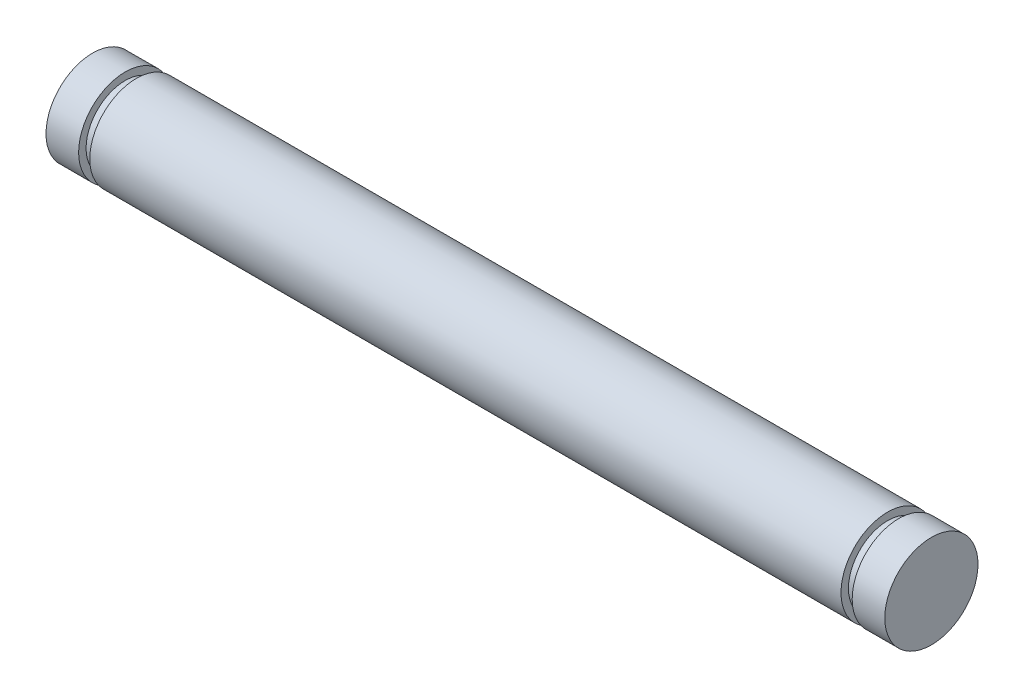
ISO-10303-21;
HEADER;
FILE_DESCRIPTION(('STEP AP214'),'2;1');
FILE_NAME('part.step','',(''),(''),'','','');
FILE_SCHEMA(('AUTOMOTIVE_DESIGN { 1 0 10303 214 1 1 1 1 }'));
ENDSEC;
DATA;
#1=APPLICATION_CONTEXT('core data for automotive mechanical design processes');
#2=APPLICATION_PROTOCOL_DEFINITION('international standard','automotive_design',2000,#1);
#3=PRODUCT_CONTEXT('',#1,'mechanical');
#4=PRODUCT('Part','Part','',(#3));
#5=PRODUCT_RELATED_PRODUCT_CATEGORY('part','',(#4));
#6=PRODUCT_DEFINITION_FORMATION('','',#4);
#7=PRODUCT_DEFINITION_CONTEXT('part definition',#1,'design');
#8=PRODUCT_DEFINITION('design','',#6,#7);
#9=PRODUCT_DEFINITION_SHAPE('','',#8);
#10=(LENGTH_UNIT() NAMED_UNIT(*) SI_UNIT(.MILLI.,.METRE.));
#11=(NAMED_UNIT(*) PLANE_ANGLE_UNIT() SI_UNIT($,.RADIAN.));
#12=(NAMED_UNIT(*) SI_UNIT($,.STERADIAN.) SOLID_ANGLE_UNIT());
#13=UNCERTAINTY_MEASURE_WITH_UNIT(LENGTH_MEASURE(1.E-05),#10,'distance_accuracy_value','');
#14=(GEOMETRIC_REPRESENTATION_CONTEXT(3) GLOBAL_UNCERTAINTY_ASSIGNED_CONTEXT((#13)) GLOBAL_UNIT_ASSIGNED_CONTEXT((#10,
#11,#12)) REPRESENTATION_CONTEXT('',''));
#15=CARTESIAN_POINT('',(0.,0.,0.));
#16=DIRECTION('',(0.,0.,1.));
#17=DIRECTION('',(1.,0.,0.));
#18=AXIS2_PLACEMENT_3D('',#15,#16,#17);
#19=CARTESIAN_POINT('',(57.15,0.,0.));
#20=DIRECTION('',(-1.,0.,0.));
#21=DIRECTION('',(0.,0.,1.));
#22=AXIS2_PLACEMENT_3D('',#19,#20,#21);
#23=CYLINDRICAL_SURFACE('',#22,3.175);
#24=CARTESIAN_POINT('',(0.,0.,0.));
#25=DIRECTION('',(1.,0.,0.));
#26=DIRECTION('',(0.,0.,-1.));
#27=AXIS2_PLACEMENT_3D('',#24,#25,#26);
#28=CIRCLE('',#27,3.175);
#29=CARTESIAN_POINT('',(0.,0.,-3.175));
#30=VERTEX_POINT('',#29);
#31=EDGE_CURVE('E40',#30,#30,#28,.T.);
#32=ORIENTED_EDGE('',*,*,#31,.T.);
#33=EDGE_LOOP('',(#32));
#34=FACE_BOUND('',#33,.T.);
#35=CARTESIAN_POINT('',(2.2225,0.,0.));
#36=DIRECTION('',(-1.,0.,0.));
#37=DIRECTION('',(0.,0.,1.));
#38=AXIS2_PLACEMENT_3D('',#35,#36,#37);
#39=CIRCLE('',#38,3.175);
#40=CARTESIAN_POINT('',(2.2225,0.,3.175));
#41=VERTEX_POINT('',#40);
#42=EDGE_CURVE('E52',#41,#41,#39,.T.);
#43=ORIENTED_EDGE('',*,*,#42,.T.);
#44=EDGE_LOOP('',(#43));
#45=FACE_BOUND('',#44,.T.);
#46=ADVANCED_FACE('F37',(#34,#45),#23,.T.);
#47=CARTESIAN_POINT('',(0.,0.,0.));
#48=DIRECTION('',(1.,0.,0.));
#49=DIRECTION('',(0.,0.,-1.));
#50=AXIS2_PLACEMENT_3D('',#47,#48,#49);
#51=PLANE('',#50);
#52=ORIENTED_EDGE('',*,*,#31,.F.);
#53=EDGE_LOOP('',(#52));
#54=FACE_BOUND('',#53,.T.);
#55=ADVANCED_FACE('F77',(#54),#51,.F.);
#56=CARTESIAN_POINT('',(2.2225,0.,-3.175));
#57=DIRECTION('',(1.,0.,0.));
#58=DIRECTION('',(0.,0.,-1.));
#59=AXIS2_PLACEMENT_3D('',#56,#57,#58);
#60=PLANE('',#59);
#61=CARTESIAN_POINT('',(2.2225,0.,0.));
#62=DIRECTION('',(-1.,0.,0.));
#63=DIRECTION('',(0.,0.,1.));
#64=AXIS2_PLACEMENT_3D('',#61,#62,#63);
#65=CIRCLE('',#64,2.667);
#66=CARTESIAN_POINT('',(2.2225,0.,2.667));
#67=VERTEX_POINT('',#66);
#68=EDGE_CURVE('E47',#67,#67,#65,.T.);
#69=ORIENTED_EDGE('',*,*,#68,.T.);
#70=EDGE_LOOP('',(#69));
#71=FACE_BOUND('',#70,.T.);
#72=ORIENTED_EDGE('',*,*,#42,.F.);
#73=EDGE_LOOP('',(#72));
#74=FACE_BOUND('',#73,.T.);
#75=ADVANCED_FACE('F74',(#71,#74),#60,.T.);
#76=CARTESIAN_POINT('',(0.,0.,0.));
#77=DIRECTION('',(-1.,0.,0.));
#78=DIRECTION('',(0.,0.,1.));
#79=AXIS2_PLACEMENT_3D('',#76,#77,#78);
#80=CYLINDRICAL_SURFACE('',#79,2.667);
#81=CARTESIAN_POINT('',(2.9845,0.,0.));
#82=DIRECTION('',(-1.,0.,0.));
#83=DIRECTION('',(0.,0.,1.));
#84=AXIS2_PLACEMENT_3D('',#81,#82,#83);
#85=CIRCLE('',#84,2.667);
#86=CARTESIAN_POINT('',(2.9845,0.,2.667));
#87=VERTEX_POINT('',#86);
#88=EDGE_CURVE('E64',#87,#87,#85,.T.);
#89=ORIENTED_EDGE('',*,*,#88,.T.);
#90=EDGE_LOOP('',(#89));
#91=FACE_BOUND('',#90,.T.);
#92=ORIENTED_EDGE('',*,*,#68,.F.);
#93=EDGE_LOOP('',(#92));
#94=FACE_BOUND('',#93,.T.);
#95=ADVANCED_FACE('F76',(#91,#94),#80,.T.);
#96=CARTESIAN_POINT('',(2.9845,0.,-3.175));
#97=DIRECTION('',(-1.,0.,0.));
#98=DIRECTION('',(0.,0.,1.));
#99=AXIS2_PLACEMENT_3D('',#96,#97,#98);
#100=PLANE('',#99);
#101=CARTESIAN_POINT('',(2.9845,0.,0.));
#102=DIRECTION('',(-1.,0.,0.));
#103=DIRECTION('',(0.,0.,1.));
#104=AXIS2_PLACEMENT_3D('',#101,#102,#103);
#105=CIRCLE('',#104,3.175);
#106=CARTESIAN_POINT('',(2.9845,0.,3.175));
#107=VERTEX_POINT('',#106);
#108=EDGE_CURVE('E67',#107,#107,#105,.T.);
#109=ORIENTED_EDGE('',*,*,#108,.T.);
#110=EDGE_LOOP('',(#109));
#111=FACE_BOUND('',#110,.T.);
#112=ORIENTED_EDGE('',*,*,#88,.F.);
#113=EDGE_LOOP('',(#112));
#114=FACE_BOUND('',#113,.T.);
#115=ADVANCED_FACE('F84',(#111,#114),#100,.T.);
#116=CARTESIAN_POINT('',(54.1655,0.,0.));
#117=DIRECTION('',(-1.,0.,0.));
#118=DIRECTION('',(0.,0.,1.));
#119=AXIS2_PLACEMENT_3D('',#116,#117,#118);
#120=CIRCLE('',#119,3.17500000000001);
#121=CARTESIAN_POINT('',(54.1655,0.,3.17500000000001));
#122=VERTEX_POINT('',#121);
#123=EDGE_CURVE('E49',#122,#122,#120,.T.);
#124=ORIENTED_EDGE('',*,*,#123,.T.);
#125=EDGE_LOOP('',(#124));
#126=FACE_BOUND('',#125,.T.);
#127=ORIENTED_EDGE('',*,*,#108,.F.);
#128=EDGE_LOOP('',(#127));
#129=FACE_BOUND('',#128,.T.);
#130=ADVANCED_FACE('F91',(#126,#129),#23,.T.);
#131=CARTESIAN_POINT('',(54.1655,0.,-3.17500000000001));
#132=DIRECTION('',(1.,0.,0.));
#133=DIRECTION('',(0.,0.,-1.));
#134=AXIS2_PLACEMENT_3D('',#131,#132,#133);
#135=PLANE('',#134);
#136=CARTESIAN_POINT('',(54.1655,0.,0.));
#137=DIRECTION('',(-1.,0.,0.));
#138=DIRECTION('',(0.,0.,1.));
#139=AXIS2_PLACEMENT_3D('',#136,#137,#138);
#140=CIRCLE('',#139,2.66700000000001);
#141=CARTESIAN_POINT('',(54.1655,0.,2.66700000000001));
#142=VERTEX_POINT('',#141);
#143=EDGE_CURVE('E53',#142,#142,#140,.T.);
#144=ORIENTED_EDGE('',*,*,#143,.T.);
#145=EDGE_LOOP('',(#144));
#146=FACE_BOUND('',#145,.T.);
#147=ORIENTED_EDGE('',*,*,#123,.F.);
#148=EDGE_LOOP('',(#147));
#149=FACE_BOUND('',#148,.T.);
#150=ADVANCED_FACE('F96',(#146,#149),#135,.T.);
#151=CARTESIAN_POINT('',(0.,0.,0.));
#152=DIRECTION('',(-1.,0.,0.));
#153=DIRECTION('',(0.,0.,1.));
#154=AXIS2_PLACEMENT_3D('',#151,#152,#153);
#155=CYLINDRICAL_SURFACE('',#154,2.66700000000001);
#156=CARTESIAN_POINT('',(54.9275,0.,0.));
#157=DIRECTION('',(-1.,0.,0.));
#158=DIRECTION('',(0.,0.,1.));
#159=AXIS2_PLACEMENT_3D('',#156,#157,#158);
#160=CIRCLE('',#159,2.66700000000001);
#161=CARTESIAN_POINT('',(54.9275,0.,2.66700000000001));
#162=VERTEX_POINT('',#161);
#163=EDGE_CURVE('E56',#162,#162,#160,.T.);
#164=ORIENTED_EDGE('',*,*,#163,.T.);
#165=EDGE_LOOP('',(#164));
#166=FACE_BOUND('',#165,.T.);
#167=ORIENTED_EDGE('',*,*,#143,.F.);
#168=EDGE_LOOP('',(#167));
#169=FACE_BOUND('',#168,.T.);
#170=ADVANCED_FACE('F111',(#166,#169),#155,.T.);
#171=CARTESIAN_POINT('',(54.9275,0.,-3.17500000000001));
#172=DIRECTION('',(-1.,0.,0.));
#173=DIRECTION('',(0.,0.,1.));
#174=AXIS2_PLACEMENT_3D('',#171,#172,#173);
#175=PLANE('',#174);
#176=CARTESIAN_POINT('',(54.9275,0.,0.));
#177=DIRECTION('',(-1.,0.,0.));
#178=DIRECTION('',(0.,0.,1.));
#179=AXIS2_PLACEMENT_3D('',#176,#177,#178);
#180=CIRCLE('',#179,3.17500000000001);
#181=CARTESIAN_POINT('',(54.9275,0.,3.17500000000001));
#182=VERTEX_POINT('',#181);
#183=EDGE_CURVE('E59',#182,#182,#180,.T.);
#184=ORIENTED_EDGE('',*,*,#183,.T.);
#185=EDGE_LOOP('',(#184));
#186=FACE_BOUND('',#185,.T.);
#187=ORIENTED_EDGE('',*,*,#163,.F.);
#188=EDGE_LOOP('',(#187));
#189=FACE_BOUND('',#188,.T.);
#190=ADVANCED_FACE('F104',(#186,#189),#175,.T.);
#191=CARTESIAN_POINT('',(57.15,0.,0.));
#192=DIRECTION('',(1.,0.,0.));
#193=DIRECTION('',(0.,0.,-1.));
#194=AXIS2_PLACEMENT_3D('',#191,#192,#193);
#195=PLANE('',#194);
#196=CARTESIAN_POINT('',(57.15,0.,0.));
#197=DIRECTION('',(1.,0.,0.));
#198=DIRECTION('',(0.,0.,-1.));
#199=AXIS2_PLACEMENT_3D('',#196,#197,#198);
#200=CIRCLE('',#199,3.175);
#201=CARTESIAN_POINT('',(57.15,0.,-3.175));
#202=VERTEX_POINT('',#201);
#203=EDGE_CURVE('E10',#202,#202,#200,.T.);
#204=ORIENTED_EDGE('',*,*,#203,.T.);
#205=EDGE_LOOP('',(#204));
#206=FACE_BOUND('',#205,.T.);
#207=ADVANCED_FACE('F99',(#206),#195,.T.);
#208=ORIENTED_EDGE('',*,*,#203,.F.);
#209=EDGE_LOOP('',(#208));
#210=FACE_BOUND('',#209,.T.);
#211=ORIENTED_EDGE('',*,*,#183,.F.);
#212=EDGE_LOOP('',(#211));
#213=FACE_BOUND('',#212,.T.);
#214=ADVANCED_FACE('F92',(#210,#213),#23,.T.);
#215=CLOSED_SHELL('',(#46,#55,#75,#95,#115,#130,#150,#170,#190,#207,#214));
#216=MANIFOLD_SOLID_BREP('B2',#215);
#217=ADVANCED_BREP_SHAPE_REPRESENTATION('',(#18,#216),#14);
#218=SHAPE_DEFINITION_REPRESENTATION(#9,#217);
ENDSEC;
END-ISO-10303-21;
